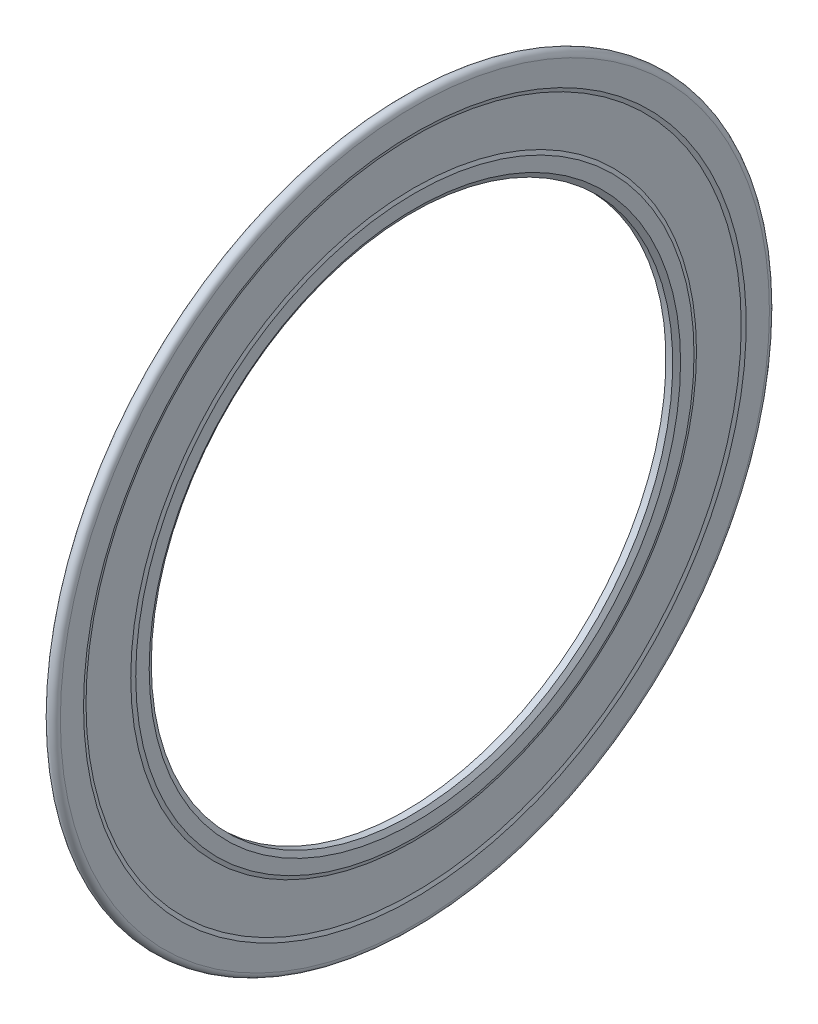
ISO-10303-21;
HEADER;
FILE_DESCRIPTION(('STEP AP214'),'2;1');
FILE_NAME('part.step','',(''),(''),'','','');
FILE_SCHEMA(('AUTOMOTIVE_DESIGN { 1 0 10303 214 1 1 1 1 }'));
ENDSEC;
DATA;
#1=APPLICATION_CONTEXT('core data for automotive mechanical design processes');
#2=APPLICATION_PROTOCOL_DEFINITION('international standard','automotive_design',2000,#1);
#3=PRODUCT_CONTEXT('',#1,'mechanical');
#4=PRODUCT('Part','Part','',(#3));
#5=PRODUCT_RELATED_PRODUCT_CATEGORY('part','',(#4));
#6=PRODUCT_DEFINITION_FORMATION('','',#4);
#7=PRODUCT_DEFINITION_CONTEXT('part definition',#1,'design');
#8=PRODUCT_DEFINITION('design','',#6,#7);
#9=PRODUCT_DEFINITION_SHAPE('','',#8);
#10=(LENGTH_UNIT() NAMED_UNIT(*) SI_UNIT(.MILLI.,.METRE.));
#11=(NAMED_UNIT(*) PLANE_ANGLE_UNIT() SI_UNIT($,.RADIAN.));
#12=(NAMED_UNIT(*) SI_UNIT($,.STERADIAN.) SOLID_ANGLE_UNIT());
#13=UNCERTAINTY_MEASURE_WITH_UNIT(LENGTH_MEASURE(1.E-05),#10,'distance_accuracy_value','');
#14=(GEOMETRIC_REPRESENTATION_CONTEXT(3) GLOBAL_UNCERTAINTY_ASSIGNED_CONTEXT((#13)) GLOBAL_UNIT_ASSIGNED_CONTEXT((#10,
#11,#12)) REPRESENTATION_CONTEXT('',''));
#15=CARTESIAN_POINT('',(0.,0.,0.));
#16=DIRECTION('',(0.,0.,1.));
#17=DIRECTION('',(1.,0.,0.));
#18=AXIS2_PLACEMENT_3D('',#15,#16,#17);
#19=CARTESIAN_POINT('',(1.16666666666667,0.,0.));
#20=DIRECTION('',(1.,0.,0.));
#21=DIRECTION('',(0.,0.,-1.));
#22=AXIS2_PLACEMENT_3D('',#19,#20,#21);
#23=CONICAL_SURFACE('',#22,21.1082905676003,1.0471975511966);
#24=CARTESIAN_POINT('',(0.93861333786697,0.,0.));
#25=DIRECTION('',(-1.,0.,0.));
#26=DIRECTION('',(0.,0.,1.));
#27=AXIS2_PLACEMENT_3D('',#24,#25,#26);
#28=CIRCLE('',#27,20.7132906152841);
#29=CARTESIAN_POINT('',(0.93861333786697,0.,20.7132906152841));
#30=VERTEX_POINT('',#29);
#31=EDGE_CURVE('E10',#30,#30,#28,.T.);
#32=ORIENTED_EDGE('',*,*,#31,.T.);
#33=EDGE_LOOP('',(#32));
#34=FACE_BOUND('',#33,.T.);
#35=CARTESIAN_POINT('',(1.16666666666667,0.,0.));
#36=DIRECTION('',(-1.,0.,0.));
#37=DIRECTION('',(0.,0.,1.));
#38=AXIS2_PLACEMENT_3D('',#35,#36,#37);
#39=CIRCLE('',#38,21.1082905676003);
#40=CARTESIAN_POINT('',(1.16666666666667,0.,21.1082905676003));
#41=VERTEX_POINT('',#40);
#42=EDGE_CURVE('E57',#41,#41,#39,.T.);
#43=ORIENTED_EDGE('',*,*,#42,.F.);
#44=EDGE_LOOP('',(#43));
#45=FACE_BOUND('',#44,.T.);
#46=ADVANCED_FACE('F14',(#34,#45),#23,.F.);
#47=CARTESIAN_POINT('',(0.,0.,0.));
#48=DIRECTION('',(-1.,0.,0.));
#49=DIRECTION('',(0.,0.,1.));
#50=AXIS2_PLACEMENT_3D('',#47,#48,#49);
#51=CYLINDRICAL_SURFACE('',#50,20.7132906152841);
#52=CARTESIAN_POINT('',(0.399753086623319,0.,0.));
#53=DIRECTION('',(-1.,0.,0.));
#54=DIRECTION('',(0.,0.,1.));
#55=AXIS2_PLACEMENT_3D('',#52,#53,#54);
#56=CIRCLE('',#55,20.7132906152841);
#57=CARTESIAN_POINT('',(0.399753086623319,0.,20.7132906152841));
#58=VERTEX_POINT('',#57);
#59=EDGE_CURVE('E20',#58,#58,#56,.T.);
#60=ORIENTED_EDGE('',*,*,#59,.T.);
#61=EDGE_LOOP('',(#60));
#62=FACE_BOUND('',#61,.T.);
#63=ORIENTED_EDGE('',*,*,#31,.F.);
#64=EDGE_LOOP('',(#63));
#65=FACE_BOUND('',#64,.T.);
#66=ADVANCED_FACE('F65',(#62,#65),#51,.F.);
#67=CARTESIAN_POINT('',(0.399753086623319,0.,0.));
#68=DIRECTION('',(1.,0.,0.));
#69=DIRECTION('',(0.,0.,-1.));
#70=AXIS2_PLACEMENT_3D('',#67,#68,#69);
#71=CONICAL_SURFACE('',#70,20.7132906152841,1.0471975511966);
#72=CARTESIAN_POINT('',(0.7,0.,0.));
#73=DIRECTION('',(-1.,0.,0.));
#74=DIRECTION('',(0.,0.,1.));
#75=AXIS2_PLACEMENT_3D('',#72,#73,#74);
#76=CIRCLE('',#75,21.2333335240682);
#77=CARTESIAN_POINT('',(0.7,0.,21.2333335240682));
#78=VERTEX_POINT('',#77);
#79=EDGE_CURVE('E24',#78,#78,#76,.T.);
#80=ORIENTED_EDGE('',*,*,#79,.T.);
#81=EDGE_LOOP('',(#80));
#82=FACE_BOUND('',#81,.T.);
#83=ORIENTED_EDGE('',*,*,#59,.F.);
#84=EDGE_LOOP('',(#83));
#85=FACE_BOUND('',#84,.T.);
#86=ADVANCED_FACE('F70',(#82,#85),#71,.T.);
#87=CARTESIAN_POINT('',(0.7,21.2333335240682,0.));
#88=DIRECTION('',(-1.,0.,0.));
#89=DIRECTION('',(0.,0.,1.));
#90=AXIS2_PLACEMENT_3D('',#87,#88,#89);
#91=PLANE('',#90);
#92=CARTESIAN_POINT('',(0.7,0.,0.));
#93=DIRECTION('',(-1.,0.,0.));
#94=DIRECTION('',(0.,0.,1.));
#95=AXIS2_PLACEMENT_3D('',#92,#93,#94);
#96=CIRCLE('',#95,21.767313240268);
#97=CARTESIAN_POINT('',(0.7,0.,21.767313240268));
#98=VERTEX_POINT('',#97);
#99=EDGE_CURVE('E28',#98,#98,#96,.T.);
#100=ORIENTED_EDGE('',*,*,#99,.T.);
#101=EDGE_LOOP('',(#100));
#102=FACE_BOUND('',#101,.T.);
#103=ORIENTED_EDGE('',*,*,#79,.F.);
#104=EDGE_LOOP('',(#103));
#105=FACE_BOUND('',#104,.T.);
#106=ADVANCED_FACE('F74',(#102,#105),#91,.T.);
#107=CARTESIAN_POINT('',(0.133333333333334,0.,0.));
#108=DIRECTION('',(-1.,0.,0.));
#109=DIRECTION('',(0.,0.,1.));
#110=AXIS2_PLACEMENT_3D('',#107,#108,#109);
#111=CONICAL_SURFACE('',#110,23.446063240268,1.24525312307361);
#112=ORIENTED_EDGE('',*,*,#99,.F.);
#113=EDGE_LOOP('',(#112));
#114=FACE_BOUND('',#113,.T.);
#115=CARTESIAN_POINT('',(0.133333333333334,0.,0.));
#116=DIRECTION('',(-1.,0.,0.));
#117=DIRECTION('',(0.,0.,1.));
#118=AXIS2_PLACEMENT_3D('',#115,#116,#117);
#119=CIRCLE('',#118,23.446063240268);
#120=CARTESIAN_POINT('',(0.133333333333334,0.,23.446063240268));
#121=VERTEX_POINT('',#120);
#122=EDGE_CURVE('E33',#121,#121,#119,.T.);
#123=ORIENTED_EDGE('',*,*,#122,.T.);
#124=EDGE_LOOP('',(#123));
#125=FACE_BOUND('',#124,.T.);
#126=ADVANCED_FACE('F81',(#114,#125),#111,.F.);
#127=CARTESIAN_POINT('',(0.133333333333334,28.165285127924,0.));
#128=DIRECTION('',(1.,0.,0.));
#129=DIRECTION('',(0.,0.,-1.));
#130=AXIS2_PLACEMENT_3D('',#127,#128,#129);
#131=PLANE('',#130);
#132=ORIENTED_EDGE('',*,*,#122,.F.);
#133=EDGE_LOOP('',(#132));
#134=FACE_BOUND('',#133,.T.);
#135=CARTESIAN_POINT('',(0.133333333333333,0.,0.));
#136=DIRECTION('',(-1.,0.,0.));
#137=DIRECTION('',(0.,0.,1.));
#138=AXIS2_PLACEMENT_3D('',#135,#136,#137);
#139=CIRCLE('',#138,28.165285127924);
#140=CARTESIAN_POINT('',(0.133333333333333,0.,28.165285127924));
#141=VERTEX_POINT('',#140);
#142=EDGE_CURVE('E36',#141,#141,#139,.T.);
#143=ORIENTED_EDGE('',*,*,#142,.T.);
#144=EDGE_LOOP('',(#143));
#145=FACE_BOUND('',#144,.T.);
#146=ADVANCED_FACE('F85',(#134,#145),#131,.F.);
#147=CARTESIAN_POINT('',(0.,0.,0.));
#148=DIRECTION('',(-1.,0.,0.));
#149=DIRECTION('',(0.,0.,1.));
#150=AXIS2_PLACEMENT_3D('',#147,#148,#149);
#151=CYLINDRICAL_SURFACE('',#150,28.165285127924);
#152=ORIENTED_EDGE('',*,*,#142,.F.);
#153=EDGE_LOOP('',(#152));
#154=FACE_BOUND('',#153,.T.);
#155=CARTESIAN_POINT('',(0.233333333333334,0.,0.));
#156=DIRECTION('',(-1.,0.,0.));
#157=DIRECTION('',(0.,0.,1.));
#158=AXIS2_PLACEMENT_3D('',#155,#156,#157);
#159=CIRCLE('',#158,28.165285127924);
#160=CARTESIAN_POINT('',(0.233333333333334,0.,28.165285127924));
#161=VERTEX_POINT('',#160);
#162=EDGE_CURVE('E39',#161,#161,#159,.T.);
#163=ORIENTED_EDGE('',*,*,#162,.T.);
#164=EDGE_LOOP('',(#163));
#165=FACE_BOUND('',#164,.T.);
#166=ADVANCED_FACE('F89',(#154,#165),#151,.T.);
#167=CARTESIAN_POINT('',(0.7,0.,0.));
#168=DIRECTION('',(-1.,0.,0.));
#169=DIRECTION('',(0.,0.,1.));
#170=AXIS2_PLACEMENT_3D('',#167,#168,#169);
#171=TOROIDAL_SURFACE('',#170,28.165285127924,0.466666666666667);
#172=ORIENTED_EDGE('',*,*,#162,.F.);
#173=EDGE_LOOP('',(#172));
#174=FACE_BOUND('',#173,.T.);
#175=CARTESIAN_POINT('',(1.16666666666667,0.,0.));
#176=DIRECTION('',(-1.,0.,0.));
#177=DIRECTION('',(0.,0.,1.));
#178=AXIS2_PLACEMENT_3D('',#175,#176,#177);
#179=CIRCLE('',#178,28.165285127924);
#180=CARTESIAN_POINT('',(1.16666666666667,0.,28.165285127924));
#181=VERTEX_POINT('',#180);
#182=EDGE_CURVE('E42',#181,#181,#179,.T.);
#183=ORIENTED_EDGE('',*,*,#182,.T.);
#184=EDGE_LOOP('',(#183));
#185=FACE_BOUND('',#184,.T.);
#186=ADVANCED_FACE('F93',(#174,#185),#171,.T.);
#187=CARTESIAN_POINT('',(1.16666666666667,28.165285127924,0.));
#188=DIRECTION('',(1.,0.,0.));
#189=DIRECTION('',(0.,0.,-1.));
#190=AXIS2_PLACEMENT_3D('',#187,#188,#189);
#191=PLANE('',#190);
#192=CARTESIAN_POINT('',(1.16666666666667,0.,0.));
#193=DIRECTION('',(-1.,0.,0.));
#194=DIRECTION('',(0.,0.,1.));
#195=AXIS2_PLACEMENT_3D('',#192,#193,#194);
#196=CIRCLE('',#195,26.32375);
#197=CARTESIAN_POINT('',(1.16666666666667,0.,26.32375));
#198=VERTEX_POINT('',#197);
#199=EDGE_CURVE('E45',#198,#198,#196,.T.);
#200=ORIENTED_EDGE('',*,*,#199,.T.);
#201=EDGE_LOOP('',(#200));
#202=FACE_BOUND('',#201,.T.);
#203=ORIENTED_EDGE('',*,*,#182,.F.);
#204=EDGE_LOOP('',(#203));
#205=FACE_BOUND('',#204,.T.);
#206=ADVANCED_FACE('F97',(#202,#205),#191,.T.);
#207=CARTESIAN_POINT('',(1.06666666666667,0.,0.));
#208=DIRECTION('',(1.,0.,0.));
#209=DIRECTION('',(0.,0.,-1.));
#210=AXIS2_PLACEMENT_3D('',#207,#208,#209);
#211=CONICAL_SURFACE('',#210,26.0275,1.24525312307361);
#212=ORIENTED_EDGE('',*,*,#199,.F.);
#213=EDGE_LOOP('',(#212));
#214=FACE_BOUND('',#213,.T.);
#215=CARTESIAN_POINT('',(1.06666666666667,0.,0.));
#216=DIRECTION('',(-1.,0.,0.));
#217=DIRECTION('',(0.,0.,1.));
#218=AXIS2_PLACEMENT_3D('',#215,#216,#217);
#219=CIRCLE('',#218,26.0275);
#220=CARTESIAN_POINT('',(1.06666666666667,0.,26.0275));
#221=VERTEX_POINT('',#220);
#222=EDGE_CURVE('E48',#221,#221,#219,.T.);
#223=ORIENTED_EDGE('',*,*,#222,.T.);
#224=EDGE_LOOP('',(#223));
#225=FACE_BOUND('',#224,.T.);
#226=ADVANCED_FACE('F101',(#214,#225),#211,.F.);
#227=CARTESIAN_POINT('',(1.06666666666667,22.4725,0.));
#228=DIRECTION('',(-1.,0.,0.));
#229=DIRECTION('',(0.,0.,1.));
#230=AXIS2_PLACEMENT_3D('',#227,#228,#229);
#231=PLANE('',#230);
#232=ORIENTED_EDGE('',*,*,#222,.F.);
#233=EDGE_LOOP('',(#232));
#234=FACE_BOUND('',#233,.T.);
#235=CARTESIAN_POINT('',(1.06666666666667,0.,0.));
#236=DIRECTION('',(-1.,0.,0.));
#237=DIRECTION('',(0.,0.,1.));
#238=AXIS2_PLACEMENT_3D('',#235,#236,#237);
#239=CIRCLE('',#238,22.4725);
#240=CARTESIAN_POINT('',(1.06666666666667,0.,22.4725));
#241=VERTEX_POINT('',#240);
#242=EDGE_CURVE('E51',#241,#241,#239,.T.);
#243=ORIENTED_EDGE('',*,*,#242,.T.);
#244=EDGE_LOOP('',(#243));
#245=FACE_BOUND('',#244,.T.);
#246=ADVANCED_FACE('F105',(#234,#245),#231,.F.);
#247=CARTESIAN_POINT('',(1.16666666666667,0.,0.));
#248=DIRECTION('',(-1.,0.,0.));
#249=DIRECTION('',(0.,0.,1.));
#250=AXIS2_PLACEMENT_3D('',#247,#248,#249);
#251=CONICAL_SURFACE('',#250,22.17625,1.24525312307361);
#252=ORIENTED_EDGE('',*,*,#242,.F.);
#253=EDGE_LOOP('',(#252));
#254=FACE_BOUND('',#253,.T.);
#255=CARTESIAN_POINT('',(1.16666666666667,0.,0.));
#256=DIRECTION('',(-1.,0.,0.));
#257=DIRECTION('',(0.,0.,1.));
#258=AXIS2_PLACEMENT_3D('',#255,#256,#257);
#259=CIRCLE('',#258,22.17625);
#260=CARTESIAN_POINT('',(1.16666666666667,0.,22.17625));
#261=VERTEX_POINT('',#260);
#262=EDGE_CURVE('E54',#261,#261,#259,.T.);
#263=ORIENTED_EDGE('',*,*,#262,.T.);
#264=EDGE_LOOP('',(#263));
#265=FACE_BOUND('',#264,.T.);
#266=ADVANCED_FACE('F109',(#254,#265),#251,.T.);
#267=CARTESIAN_POINT('',(1.16666666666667,22.17625,0.));
#268=DIRECTION('',(1.,0.,0.));
#269=DIRECTION('',(0.,0.,-1.));
#270=AXIS2_PLACEMENT_3D('',#267,#268,#269);
#271=PLANE('',#270);
#272=ORIENTED_EDGE('',*,*,#42,.T.);
#273=EDGE_LOOP('',(#272));
#274=FACE_BOUND('',#273,.T.);
#275=ORIENTED_EDGE('',*,*,#262,.F.);
#276=EDGE_LOOP('',(#275));
#277=FACE_BOUND('',#276,.T.);
#278=ADVANCED_FACE('F61',(#274,#277),#271,.T.);
#279=CLOSED_SHELL('',(#46,#66,#86,#106,#126,#146,#166,#186,#206,#226,#246,#266,#278));
#280=MANIFOLD_SOLID_BREP('B1',#279);
#281=ADVANCED_BREP_SHAPE_REPRESENTATION('',(#18,#280),#14);
#282=SHAPE_DEFINITION_REPRESENTATION(#9,#281);
ENDSEC;
END-ISO-10303-21;
